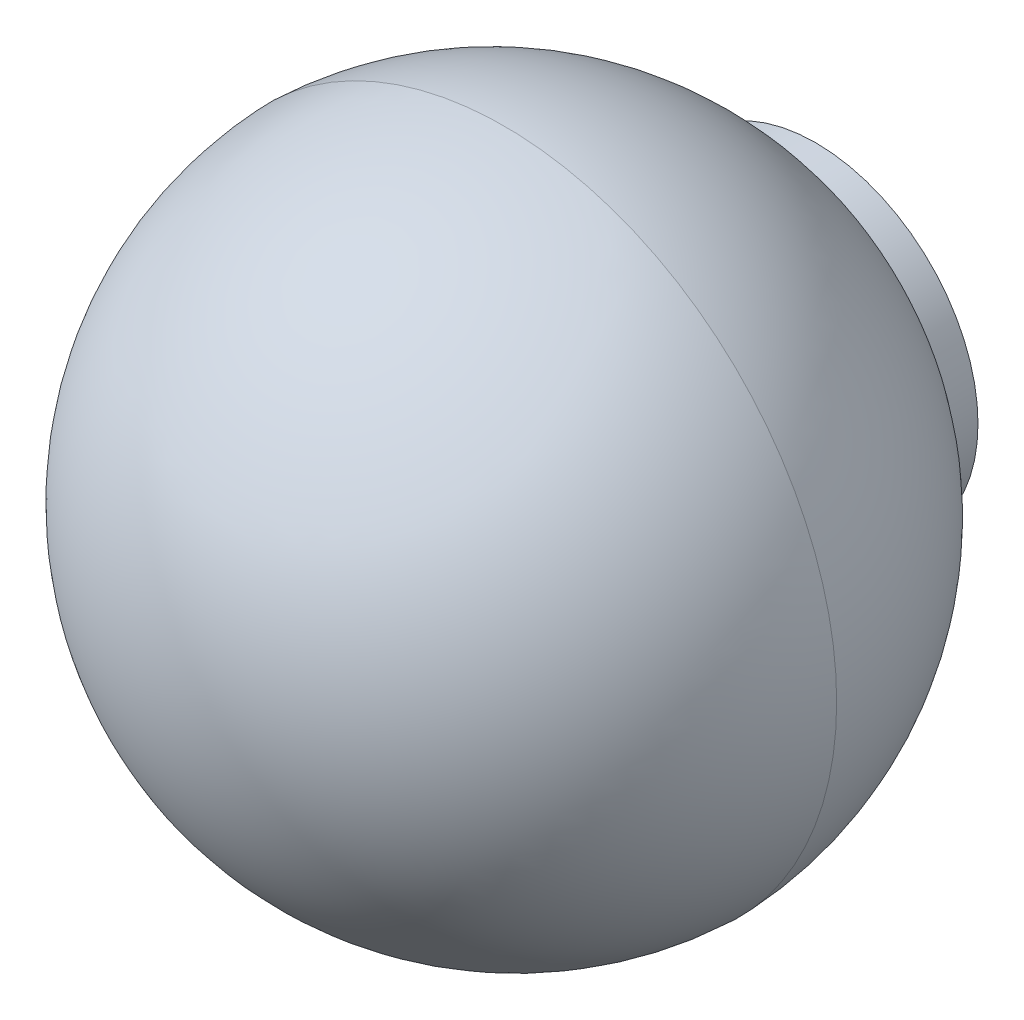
ISO-10303-21;
HEADER;
FILE_DESCRIPTION(('STEP AP214'),'2;1');
FILE_NAME('part.step','',(''),(''),'','','');
FILE_SCHEMA(('AUTOMOTIVE_DESIGN { 1 0 10303 214 1 1 1 1 }'));
ENDSEC;
DATA;
#1=APPLICATION_CONTEXT('core data for automotive mechanical design processes');
#2=APPLICATION_PROTOCOL_DEFINITION('international standard','automotive_design',2000,#1);
#3=PRODUCT_CONTEXT('',#1,'mechanical');
#4=PRODUCT('Part','Part','',(#3));
#5=PRODUCT_RELATED_PRODUCT_CATEGORY('part','',(#4));
#6=PRODUCT_DEFINITION_FORMATION('','',#4);
#7=PRODUCT_DEFINITION_CONTEXT('part definition',#1,'design');
#8=PRODUCT_DEFINITION('design','',#6,#7);
#9=PRODUCT_DEFINITION_SHAPE('','',#8);
#10=(LENGTH_UNIT() NAMED_UNIT(*) SI_UNIT(.MILLI.,.METRE.));
#11=(NAMED_UNIT(*) PLANE_ANGLE_UNIT() SI_UNIT($,.RADIAN.));
#12=(NAMED_UNIT(*) SI_UNIT($,.STERADIAN.) SOLID_ANGLE_UNIT());
#13=UNCERTAINTY_MEASURE_WITH_UNIT(LENGTH_MEASURE(1.E-05),#10,'distance_accuracy_value','');
#14=(GEOMETRIC_REPRESENTATION_CONTEXT(3) GLOBAL_UNCERTAINTY_ASSIGNED_CONTEXT((#13)) GLOBAL_UNIT_ASSIGNED_CONTEXT((#10,
#11,#12)) REPRESENTATION_CONTEXT('',''));
#15=CARTESIAN_POINT('',(0.,0.,0.));
#16=DIRECTION('',(0.,0.,1.));
#17=DIRECTION('',(1.,0.,0.));
#18=AXIS2_PLACEMENT_3D('',#15,#16,#17);
#19=CARTESIAN_POINT('',(0.,0.,18.));
#20=DIRECTION('',(0.,0.,-1.));
#21=DIRECTION('',(-1.,0.,0.));
#22=AXIS2_PLACEMENT_3D('',#19,#20,#21);
#23=SPHERICAL_SURFACE('',#22,20.);
#24=CARTESIAN_POINT('',(0.,0.,18.7312298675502));
#25=DIRECTION('',(0.,0.,-1.));
#26=DIRECTION('',(0.,1.,0.));
#27=AXIS2_PLACEMENT_3D('',#24,#25,#26);
#28=CIRCLE('',#27,19.9866281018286);
#29=CARTESIAN_POINT('',(-19.9866281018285,0.,18.7312298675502));
#30=VERTEX_POINT('',#29);
#31=EDGE_CURVE('E8',#30,#30,#28,.T.);
#32=ORIENTED_EDGE('',*,*,#31,.F.);
#33=EDGE_LOOP('',(#32));
#34=FACE_BOUND('',#33,.T.);
#35=ADVANCED_FACE('F12',(#34),#23,.T.);
#36=CARTESIAN_POINT('',(0.,0.,19.4624597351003));
#37=DIRECTION('',(0.,0.,-1.));
#38=DIRECTION('',(-1.,0.,0.));
#39=AXIS2_PLACEMENT_3D('',#36,#37,#38);
#40=SPHERICAL_SURFACE('',#39,20.);
#41=CARTESIAN_POINT('',(0.,0.,2.));
#42=DIRECTION('',(0.,0.,-1.));
#43=DIRECTION('',(0.,1.,0.));
#44=AXIS2_PLACEMENT_3D('',#41,#42,#43);
#45=CIRCLE('',#44,9.75);
#46=CARTESIAN_POINT('',(-9.75000000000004,0.,2.));
#47=VERTEX_POINT('',#46);
#48=EDGE_CURVE('E18',#47,#47,#45,.T.);
#49=CARTESIAN_POINT('',(-9.75000000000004,0.,2.));
#50=CARTESIAN_POINT('',(-9.93644924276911,0.,2.10410073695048));
#51=CARTESIAN_POINT('',(-10.1212299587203,0.,2.21118969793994));
#52=CARTESIAN_POINT('',(-10.4872676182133,0.,2.43122946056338));
#53=CARTESIAN_POINT('',(-10.6685245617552,0.,2.54418026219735));
#54=CARTESIAN_POINT('',(-11.0273279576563,0.,2.7758290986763));
#55=CARTESIAN_POINT('',(-11.2048744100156,0.,2.89452713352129));
#56=CARTESIAN_POINT('',(-11.5560748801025,0.,3.13754832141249));
#57=CARTESIAN_POINT('',(-11.7297288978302,0.,3.26187147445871));
#58=CARTESIAN_POINT('',(-12.0729662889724,0.,3.51601544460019));
#59=CARTESIAN_POINT('',(-12.2425496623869,0.,3.64583626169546));
#60=CARTESIAN_POINT('',(-12.5774718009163,0.,3.9108423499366));
#61=CARTESIAN_POINT('',(-12.7428105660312,0.,4.04602762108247));
#62=CARTESIAN_POINT('',(-13.0690738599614,0.,4.3216239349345));
#63=CARTESIAN_POINT('',(-13.2299983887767,0.,4.46203497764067));
#64=CARTESIAN_POINT('',(-13.5472681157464,0.,4.74793878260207));
#65=CARTESIAN_POINT('',(-13.7036133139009,0.,4.89343154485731));
#66=CARTESIAN_POINT('',(-14.0115639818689,0.,5.1893495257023));
#67=CARTESIAN_POINT('',(-14.1631694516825,0.,5.33977474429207));
#68=CARTESIAN_POINT('',(-14.4614851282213,0.,5.64540331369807));
#69=CARTESIAN_POINT('',(-14.6081953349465,0.,5.80060666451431));
#70=CARTESIAN_POINT('',(-14.8965699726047,0.,6.1156322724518));
#71=CARTESIAN_POINT('',(-15.0382344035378,0.,6.27545452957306));
#72=CARTESIAN_POINT('',(-15.3163721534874,0.,6.59955398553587));
#73=CARTESIAN_POINT('',(-15.4528454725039,0.,6.76383118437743));
#74=CARTESIAN_POINT('',(-15.7204609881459,0.,7.09667198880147));
#75=CARTESIAN_POINT('',(-15.8516031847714,0.,7.26523559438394));
#76=CARTESIAN_POINT('',(-16.1084219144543,0.,7.60647627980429));
#77=CARTESIAN_POINT('',(-16.2340984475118,0.,7.77915335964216));
#78=CARTESIAN_POINT('',(-16.4798569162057,0.,8.12844384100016));
#79=CARTESIAN_POINT('',(-16.599938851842,0.,8.30505724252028));
#80=CARTESIAN_POINT('',(-16.8343849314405,0.,8.66203917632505));
#81=CARTESIAN_POINT('',(-16.9487490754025,0.,8.8424077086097));
#82=CARTESIAN_POINT('',(-17.1716422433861,0.,9.20671486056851));
#83=CARTESIAN_POINT('',(-17.2801712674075,0.,9.39065348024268));
#84=CARTESIAN_POINT('',(-17.4912828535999,0.,9.7619121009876));
#85=CARTESIAN_POINT('',(-17.5938654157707,0.,9.94923210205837));
#86=CARTESIAN_POINT('',(-17.7929788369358,0.,10.3270613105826));
#87=CARTESIAN_POINT('',(-17.8895096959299,0.,10.517570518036));
#88=CARTESIAN_POINT('',(-18.0764206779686,0.,10.9015826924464));
#89=CARTESIAN_POINT('',(-18.1668008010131,0.,11.0950856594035));
#90=CARTESIAN_POINT('',(-18.3413175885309,0.,11.4848868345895));
#91=CARTESIAN_POINT('',(-18.4254542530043,0.,11.6811850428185));
#92=CARTESIAN_POINT('',(-18.5873978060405,0.,12.0763753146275));
#93=CARTESIAN_POINT('',(-18.6652046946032,0.,12.2752673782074));
#94=CARTESIAN_POINT('',(-18.814408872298,0.,12.6754413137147));
#95=CARTESIAN_POINT('',(-18.88580616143,0.,12.8767231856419));
#96=CARTESIAN_POINT('',(-19.0221178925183,0.,13.2814702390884));
#97=CARTESIAN_POINT('',(-19.0870323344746,0.,13.4849354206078));
#98=CARTESIAN_POINT('',(-19.2103117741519,0.,13.8938403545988));
#99=CARTESIAN_POINT('',(-19.2686767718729,0.,14.0992801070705));
#100=CARTESIAN_POINT('',(-19.3787974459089,0.,14.5119234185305));
#101=CARTESIAN_POINT('',(-19.4305531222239,0.,14.7191269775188));
#102=CARTESIAN_POINT('',(-19.5274020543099,0.,15.135085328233));
#103=CARTESIAN_POINT('',(-19.572495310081,0.,15.3438401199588));
#104=CARTESIAN_POINT('',(-19.6559731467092,0.,15.7626867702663));
#105=CARTESIAN_POINT('',(-19.6943577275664,0.,15.9727786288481));
#106=CARTESIAN_POINT('',(-19.7643788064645,0.,16.3940838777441));
#107=CARTESIAN_POINT('',(-19.7960153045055,0.,16.6052972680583));
#108=CARTESIAN_POINT('',(-19.85250786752,0.,17.0286288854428));
#109=CARTESIAN_POINT('',(-19.8773639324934,0.,17.2407471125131));
#110=CARTESIAN_POINT('',(-19.9202697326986,0.,17.6656708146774));
#111=CARTESIAN_POINT('',(-19.9383194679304,0.,17.8784762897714));
#112=CARTESIAN_POINT('',(-19.967595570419,0.,18.304556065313));
#113=CARTESIAN_POINT('',(-19.9788219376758,0.,18.5178303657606));
#114=CARTESIAN_POINT('',(-19.9866281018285,0.,18.7312298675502));
#115=B_SPLINE_CURVE_WITH_KNOTS('',3,(#49,#50,#51,#52,#53,#54,#55,#56,#57,#58,#59,#60,#61,#62,
#63,#64,#65,#66,#67,#68,#69,#70,#71,#72,#73,#74,#75,#76,#77,#78,#79,#80,#81,#82,#83,#84,#85,#86,
#87,#88,#89,#90,#91,#92,#93,#94,#95,#96,#97,#98,#99,#100,#101,#102,#103,#104,#105,#106,#107,
#108,#109,#110,#111,#112,#113,#114),.UNSPECIFIED.,.F.,.F.,(4,2,2,2,2,2,2,2,2,2,2,2,2,2,2,2,2,2,
2,2,2,2,2,2,2,2,2,2,2,2,2,2,4),(0.,0.640599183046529,1.28119836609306,1.92179754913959,
2.56239673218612,3.20299591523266,3.84359509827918,4.48419428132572,5.12479346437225,
5.76539264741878,6.40599183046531,7.04659101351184,7.68719019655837,8.3277893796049,
8.96838856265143,9.60898774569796,10.2495869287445,10.890186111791,11.5307852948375,
12.1713844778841,12.8119836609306,13.4525828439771,14.0931820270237,14.7337812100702,
15.3743803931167,16.0149795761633,16.6555787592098,17.2961779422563,17.9367771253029,
18.5773763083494,19.2179754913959,19.8585746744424,20.499173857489),.UNSPECIFIED.);
#116=EDGE_CURVE('BSEAM51',#47,#30,#115,.T.);
#117=ORIENTED_EDGE('',*,*,#48,.F.);
#118=ORIENTED_EDGE('',*,*,#31,.T.);
#119=ORIENTED_EDGE('',*,*,#116,.T.);
#120=ORIENTED_EDGE('',*,*,#116,.F.);
#121=EDGE_LOOP('',(#117,#119,#118,#120));
#122=FACE_BOUND('',#121,.T.);
#123=ADVANCED_FACE('F51',(#122),#40,.T.);
#124=CARTESIAN_POINT('',(0.,0.,-5.));
#125=DIRECTION('',(0.,0.,-1.));
#126=DIRECTION('',(0.,1.,0.));
#127=AXIS2_PLACEMENT_3D('',#124,#125,#126);
#128=CYLINDRICAL_SURFACE('',#127,9.75);
#129=CARTESIAN_POINT('',(0.,0.,0.));
#130=DIRECTION('',(0.,0.,-1.));
#131=DIRECTION('',(0.,1.,0.));
#132=AXIS2_PLACEMENT_3D('',#129,#130,#131);
#133=CIRCLE('',#132,9.75);
#134=CARTESIAN_POINT('',(0.,9.75,0.));
#135=VERTEX_POINT('',#134);
#136=EDGE_CURVE('E22',#135,#135,#133,.T.);
#137=ORIENTED_EDGE('',*,*,#136,.F.);
#138=EDGE_LOOP('',(#137));
#139=FACE_BOUND('',#138,.T.);
#140=ORIENTED_EDGE('',*,*,#48,.T.);
#141=EDGE_LOOP('',(#140));
#142=FACE_BOUND('',#141,.T.);
#143=ADVANCED_FACE('F46',(#139,#142),#128,.T.);
#144=CARTESIAN_POINT('',(-9.75,0.,0.));
#145=DIRECTION('',(0.,0.,1.));
#146=DIRECTION('',(0.,-1.,0.));
#147=AXIS2_PLACEMENT_3D('',#144,#145,#146);
#148=PLANE('',#147);
#149=CARTESIAN_POINT('',(0.,0.,0.));
#150=DIRECTION('',(0.,0.,-1.));
#151=DIRECTION('',(0.,1.,0.));
#152=AXIS2_PLACEMENT_3D('',#149,#150,#151);
#153=CIRCLE('',#152,6.);
#154=CARTESIAN_POINT('',(0.,6.,0.));
#155=VERTEX_POINT('',#154);
#156=EDGE_CURVE('E26',#155,#155,#153,.T.);
#157=ORIENTED_EDGE('',*,*,#156,.F.);
#158=EDGE_LOOP('',(#157));
#159=FACE_BOUND('',#158,.T.);
#160=ORIENTED_EDGE('',*,*,#136,.T.);
#161=EDGE_LOOP('',(#160));
#162=FACE_BOUND('',#161,.T.);
#163=ADVANCED_FACE('F40',(#159,#162),#148,.F.);
#164=CARTESIAN_POINT('',(0.,0.,-5.));
#165=DIRECTION('',(0.,0.,-1.));
#166=DIRECTION('',(0.,1.,0.));
#167=AXIS2_PLACEMENT_3D('',#164,#165,#166);
#168=CYLINDRICAL_SURFACE('',#167,6.);
#169=CARTESIAN_POINT('',(0.,0.,20.));
#170=DIRECTION('',(0.,0.,-1.));
#171=DIRECTION('',(0.,1.,0.));
#172=AXIS2_PLACEMENT_3D('',#169,#170,#171);
#173=CIRCLE('',#172,6.);
#174=CARTESIAN_POINT('',(0.,6.,20.));
#175=VERTEX_POINT('',#174);
#176=EDGE_CURVE('E31',#175,#175,#173,.T.);
#177=ORIENTED_EDGE('',*,*,#176,.F.);
#178=EDGE_LOOP('',(#177));
#179=FACE_BOUND('',#178,.T.);
#180=ORIENTED_EDGE('',*,*,#156,.T.);
#181=EDGE_LOOP('',(#180));
#182=FACE_BOUND('',#181,.T.);
#183=ADVANCED_FACE('F37',(#179,#182),#168,.F.);
#184=CARTESIAN_POINT('',(-6.,0.,20.));
#185=DIRECTION('',(0.,0.,1.));
#186=DIRECTION('',(0.,-1.,0.));
#187=AXIS2_PLACEMENT_3D('',#184,#185,#186);
#188=PLANE('',#187);
#189=ORIENTED_EDGE('',*,*,#176,.T.);
#190=EDGE_LOOP('',(#189));
#191=FACE_BOUND('',#190,.T.);
#192=ADVANCED_FACE('F35',(#191),#188,.F.);
#193=CLOSED_SHELL('',(#35,#123,#143,#163,#183,#192));
#194=MANIFOLD_SOLID_BREP('B1',#193);
#195=ADVANCED_BREP_SHAPE_REPRESENTATION('',(#18,#194),#14);
#196=SHAPE_DEFINITION_REPRESENTATION(#9,#195);
ENDSEC;
END-ISO-10303-21;
